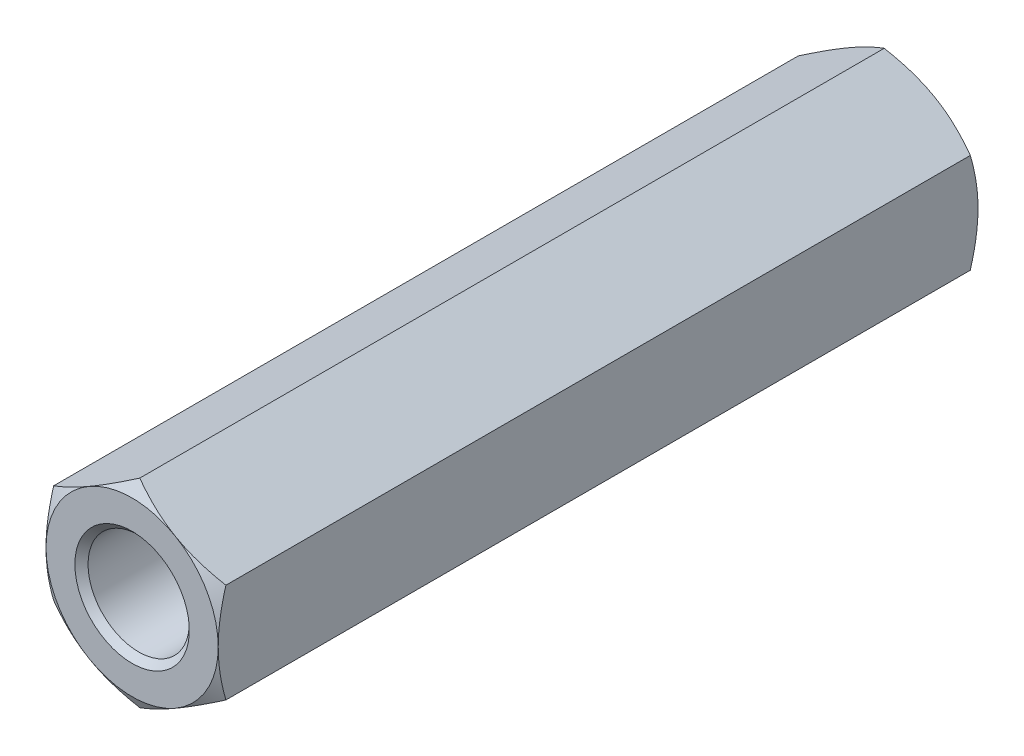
ISO-10303-21;
HEADER;
FILE_DESCRIPTION(('STEP AP214'),'2;1');
FILE_NAME('part.step','',(''),(''),'','','');
FILE_SCHEMA(('AUTOMOTIVE_DESIGN { 1 0 10303 214 1 1 1 1 }'));
ENDSEC;
DATA;
#1=APPLICATION_CONTEXT('core data for automotive mechanical design processes');
#2=APPLICATION_PROTOCOL_DEFINITION('international standard','automotive_design',2000,#1);
#3=PRODUCT_CONTEXT('',#1,'mechanical');
#4=PRODUCT('Part','Part','',(#3));
#5=PRODUCT_RELATED_PRODUCT_CATEGORY('part','',(#4));
#6=PRODUCT_DEFINITION_FORMATION('','',#4);
#7=PRODUCT_DEFINITION_CONTEXT('part definition',#1,'design');
#8=PRODUCT_DEFINITION('design','',#6,#7);
#9=PRODUCT_DEFINITION_SHAPE('','',#8);
#10=(LENGTH_UNIT() NAMED_UNIT(*) SI_UNIT(.MILLI.,.METRE.));
#11=(NAMED_UNIT(*) PLANE_ANGLE_UNIT() SI_UNIT($,.RADIAN.));
#12=(NAMED_UNIT(*) SI_UNIT($,.STERADIAN.) SOLID_ANGLE_UNIT());
#13=UNCERTAINTY_MEASURE_WITH_UNIT(LENGTH_MEASURE(1.E-05),#10,'distance_accuracy_value','');
#14=(GEOMETRIC_REPRESENTATION_CONTEXT(3) GLOBAL_UNCERTAINTY_ASSIGNED_CONTEXT((#13)) GLOBAL_UNIT_ASSIGNED_CONTEXT((#10,
#11,#12)) REPRESENTATION_CONTEXT('',''));
#15=CARTESIAN_POINT('',(0.,0.,0.));
#16=DIRECTION('',(0.,0.,1.));
#17=DIRECTION('',(1.,0.,0.));
#18=AXIS2_PLACEMENT_3D('',#15,#16,#17);
#19=CARTESIAN_POINT('',(8.5,4.90747728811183,75.));
#20=DIRECTION('',(-0.5,-0.866025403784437,0.));
#21=DIRECTION('',(-0.866025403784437,0.5,0.));
#22=AXIS2_PLACEMENT_3D('',#19,#20,#21);
#23=PLANE('',#22);
#24=CARTESIAN_POINT('',(-0.000199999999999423,9.8150700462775,0.759256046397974));
#25=CARTESIAN_POINT('',(0.18663922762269,9.70719836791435,0.696986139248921));
#26=CARTESIAN_POINT('',(0.374175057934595,9.59892450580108,0.637542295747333));
#27=CARTESIAN_POINT('',(0.750769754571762,9.38149745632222,0.525085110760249));
#28=CARTESIAN_POINT('',(0.939829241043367,9.27234391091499,0.47207454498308));
#29=CARTESIAN_POINT('',(1.5100347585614,8.94313560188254,0.323733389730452));
#30=CARTESIAN_POINT('',(1.89343164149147,8.72178130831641,0.239358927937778));
#31=CARTESIAN_POINT('',(2.46717766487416,8.39052888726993,0.140420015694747));
#32=CARTESIAN_POINT('',(2.65581276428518,8.28162036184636,0.11223519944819));
#33=CARTESIAN_POINT('',(3.03393602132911,8.06331079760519,0.0649740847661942));
#34=CARTESIAN_POINT('',(3.22342410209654,7.95390980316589,0.0458969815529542));
#35=CARTESIAN_POINT('',(3.6027265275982,7.73491944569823,0.0173347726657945));
#36=CARTESIAN_POINT('',(3.79254025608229,7.62533043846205,0.00783878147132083));
#37=CARTESIAN_POINT('',(4.17234305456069,7.40605119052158,-0.00135762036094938));
#38=CARTESIAN_POINT('',(4.36233211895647,7.29636095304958,-0.00105833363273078));
#39=CARTESIAN_POINT('',(4.71752301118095,7.09129139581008,0.00865447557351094));
#40=CARTESIAN_POINT('',(4.8827499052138,6.99589760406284,0.0168831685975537));
#41=CARTESIAN_POINT('',(5.21281671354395,6.80533344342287,0.0405892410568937));
#42=CARTESIAN_POINT('',(5.37765660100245,6.71016309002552,0.056067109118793));
#43=CARTESIAN_POINT('',(5.87153810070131,6.4250204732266,0.113008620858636));
#44=CARTESIAN_POINT('',(6.19970550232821,6.23555293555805,0.164973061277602));
#45=CARTESIAN_POINT('',(6.85952142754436,5.85460803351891,0.294884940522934));
#46=CARTESIAN_POINT('',(7.19108574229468,5.66317928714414,0.373383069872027));
#47=CARTESIAN_POINT('',(7.84926989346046,5.28317649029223,0.551541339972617));
#48=CARTESIAN_POINT('',(8.17589815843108,5.0945975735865,0.651159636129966));
#49=CARTESIAN_POINT('',(8.5002,4.90736181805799,0.759256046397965));
#50=B_SPLINE_CURVE_WITH_KNOTS('',3,(#24,#25,#26,#27,#28,#29,#30,#31,#32,#33,#34,#35,#36,#37,#38,
#39,#40,#41,#42,#43,#44,#45,#46,#47,#48,#49),.UNSPECIFIED.,.F.,.F.,(4,2,2,2,2,2,2,2,2,2,2,2,4),
(0.,0.673596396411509,1.34748239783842,2.69805431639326,3.356799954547,4.01548737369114,
4.67342558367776,5.33134346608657,5.90409556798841,6.47688628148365,7.62328361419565,
8.79510569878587,9.96462743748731),.UNSPECIFIED.);
#51=CARTESIAN_POINT('',(0.,9.81495457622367,0.759189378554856));
#52=VERTEX_POINT('',#51);
#53=CARTESIAN_POINT('',(4.25,7.36121593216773,0.));
#54=VERTEX_POINT('',#53);
#55=EDGE_CURVE('E330',#52,#54,#50,.T.);
#56=ORIENTED_EDGE('',*,*,#55,.F.);
#57=DIRECTION('',(0.,0.,-1.));
#58=VECTOR('',#57,1.);
#59=CARTESIAN_POINT('',(0.,9.81495457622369,75.));
#60=LINE('',#59,#58);
#61=CARTESIAN_POINT('',(0.,9.81495457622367,74.2408106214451));
#62=VERTEX_POINT('',#61);
#63=EDGE_CURVE('E239',#62,#52,#60,.T.);
#64=ORIENTED_EDGE('',*,*,#63,.F.);
#65=CARTESIAN_POINT('',(8.5002,4.90736181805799,74.240743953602));
#66=CARTESIAN_POINT('',(8.31336077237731,5.01523349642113,74.3030138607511));
#67=CARTESIAN_POINT('',(8.12582494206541,5.12350735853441,74.3624577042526));
#68=CARTESIAN_POINT('',(7.74923024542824,5.34093440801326,74.4749148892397));
#69=CARTESIAN_POINT('',(7.56017075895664,5.4500879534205,74.5279254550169));
#70=CARTESIAN_POINT('',(6.9899652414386,5.77929626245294,74.6762666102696));
#71=CARTESIAN_POINT('',(6.60656835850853,6.00065055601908,74.7606410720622));
#72=CARTESIAN_POINT('',(6.03282233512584,6.33190297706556,74.8595799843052));
#73=CARTESIAN_POINT('',(5.84418723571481,6.44081150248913,74.8877648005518));
#74=CARTESIAN_POINT('',(5.46606397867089,6.6591210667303,74.9350259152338));
#75=CARTESIAN_POINT('',(5.27657589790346,6.7685220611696,74.954103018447));
#76=CARTESIAN_POINT('',(4.8972734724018,6.98751241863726,74.9826652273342));
#77=CARTESIAN_POINT('',(4.70745974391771,7.09710142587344,74.9921612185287));
#78=CARTESIAN_POINT('',(4.32765694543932,7.31638067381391,75.001357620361));
#79=CARTESIAN_POINT('',(4.13766788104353,7.4260709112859,75.0010583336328));
#80=CARTESIAN_POINT('',(3.78247698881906,7.6311404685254,74.9913455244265));
#81=CARTESIAN_POINT('',(3.61725009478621,7.72653426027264,74.9831168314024));
#82=CARTESIAN_POINT('',(3.28718328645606,7.91709842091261,74.9594107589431));
#83=CARTESIAN_POINT('',(3.12234339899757,8.01226877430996,74.9439328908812));
#84=CARTESIAN_POINT('',(2.6284618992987,8.29741139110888,74.8869913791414));
#85=CARTESIAN_POINT('',(2.3002944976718,8.48687892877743,74.8350269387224));
#86=CARTESIAN_POINT('',(1.64047857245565,8.86782383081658,74.705115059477));
#87=CARTESIAN_POINT('',(1.30891425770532,9.05925257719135,74.626616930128));
#88=CARTESIAN_POINT('',(0.650730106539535,9.43925537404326,74.4484586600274));
#89=CARTESIAN_POINT('',(0.324101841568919,9.62783429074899,74.34884036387));
#90=CARTESIAN_POINT('',(-0.000199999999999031,9.8150700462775,74.240743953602));
#91=B_SPLINE_CURVE_WITH_KNOTS('',3,(#65,#66,#67,#68,#69,#70,#71,#72,#73,#74,#75,#76,#77,#78,#79,
#80,#81,#82,#83,#84,#85,#86,#87,#88,#89,#90),.UNSPECIFIED.,.F.,.F.,(4,2,2,2,2,2,2,2,2,2,2,2,4),
(0.,0.673596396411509,1.34748239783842,2.69805431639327,3.35679995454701,4.01548737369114,
4.67342558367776,5.33134346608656,5.9040955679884,6.47688628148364,7.62328361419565,
8.79510569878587,9.96462743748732),.UNSPECIFIED.);
#92=CARTESIAN_POINT('',(4.25,7.36121593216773,75.));
#93=VERTEX_POINT('',#92);
#94=EDGE_CURVE('E225',#93,#62,#91,.T.);
#95=ORIENTED_EDGE('',*,*,#94,.F.);
#96=CARTESIAN_POINT('',(8.5,4.90747728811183,74.2408106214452));
#97=VERTEX_POINT('',#96);
#98=EDGE_CURVE('E301',#97,#93,#91,.T.);
#99=ORIENTED_EDGE('',*,*,#98,.F.);
#100=DIRECTION('',(0.,0.,-1.));
#101=VECTOR('',#100,1.);
#102=CARTESIAN_POINT('',(8.5,4.90747728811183,75.));
#103=LINE('',#102,#101);
#104=CARTESIAN_POINT('',(8.5,4.90747728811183,0.759189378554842));
#105=VERTEX_POINT('',#104);
#106=EDGE_CURVE('E227',#97,#105,#103,.T.);
#107=ORIENTED_EDGE('',*,*,#106,.T.);
#108=EDGE_CURVE('E37',#54,#105,#50,.T.);
#109=ORIENTED_EDGE('',*,*,#108,.F.);
#110=EDGE_LOOP('',(#56,#64,#95,#99,#107,#109));
#111=FACE_BOUND('',#110,.T.);
#112=ADVANCED_FACE('F14',(#111),#23,.F.);
#113=CARTESIAN_POINT('',(-8.5,4.90747728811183,75.));
#114=DIRECTION('',(-0.5,0.866025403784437,0.));
#115=DIRECTION('',(0.866025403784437,0.5,0.));
#116=AXIS2_PLACEMENT_3D('',#113,#114,#115);
#117=PLANE('',#116);
#118=ORIENTED_EDGE('',*,*,#63,.T.);
#119=CARTESIAN_POINT('',(0.000199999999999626,9.8150700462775,0.759256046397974));
#120=CARTESIAN_POINT('',(-0.18663922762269,9.70719836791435,0.696986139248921));
#121=CARTESIAN_POINT('',(-0.374175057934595,9.59892450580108,0.637542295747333));
#122=CARTESIAN_POINT('',(-0.750769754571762,9.38149745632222,0.525085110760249));
#123=CARTESIAN_POINT('',(-0.939829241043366,9.27234391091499,0.47207454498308));
#124=CARTESIAN_POINT('',(-1.5100347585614,8.94313560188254,0.323733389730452));
#125=CARTESIAN_POINT('',(-1.89343164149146,8.7217813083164,0.239358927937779));
#126=CARTESIAN_POINT('',(-2.46717766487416,8.39052888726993,0.140420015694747));
#127=CARTESIAN_POINT('',(-2.65581276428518,8.28162036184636,0.112235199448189));
#128=CARTESIAN_POINT('',(-3.03393602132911,8.06331079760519,0.0649740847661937));
#129=CARTESIAN_POINT('',(-3.22342410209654,7.95390980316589,0.0458969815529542));
#130=CARTESIAN_POINT('',(-3.6027265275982,7.73491944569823,0.0173347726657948));
#131=CARTESIAN_POINT('',(-3.79254025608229,7.62533043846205,0.00783878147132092));
#132=CARTESIAN_POINT('',(-4.17234305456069,7.40605119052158,-0.00135762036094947));
#133=CARTESIAN_POINT('',(-4.36233211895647,7.29636095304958,-0.00105833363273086));
#134=CARTESIAN_POINT('',(-4.71752301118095,7.09129139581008,0.008654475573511));
#135=CARTESIAN_POINT('',(-4.8827499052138,6.99589760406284,0.0168831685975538));
#136=CARTESIAN_POINT('',(-5.21281671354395,6.80533344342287,0.040589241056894));
#137=CARTESIAN_POINT('',(-5.37765660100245,6.71016309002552,0.0560671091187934));
#138=CARTESIAN_POINT('',(-5.87153810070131,6.4250204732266,0.113008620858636));
#139=CARTESIAN_POINT('',(-6.19970550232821,6.23555293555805,0.164973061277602));
#140=CARTESIAN_POINT('',(-6.85952142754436,5.85460803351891,0.294884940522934));
#141=CARTESIAN_POINT('',(-7.19108574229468,5.66317928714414,0.373383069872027));
#142=CARTESIAN_POINT('',(-7.84926989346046,5.28317649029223,0.551541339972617));
#143=CARTESIAN_POINT('',(-8.17589815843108,5.0945975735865,0.651159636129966));
#144=CARTESIAN_POINT('',(-8.5002,4.90736181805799,0.759256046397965));
#145=B_SPLINE_CURVE_WITH_KNOTS('',3,(#119,#120,#121,#122,#123,#124,#125,#126,#127,#128,#129,
#130,#131,#132,#133,#134,#135,#136,#137,#138,#139,#140,#141,#142,#143,#144),.UNSPECIFIED.,.F.,
.F.,(4,2,2,2,2,2,2,2,2,2,2,2,4),(0.,0.673596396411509,1.34748239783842,2.69805431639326,
3.356799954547,4.01548737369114,4.67342558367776,5.33134346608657,5.90409556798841,
6.47688628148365,7.62328361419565,8.79510569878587,9.96462743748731),.UNSPECIFIED.);
#146=CARTESIAN_POINT('',(-4.25,7.36121593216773,0.));
#147=VERTEX_POINT('',#146);
#148=EDGE_CURVE('E184',#52,#147,#145,.T.);
#149=ORIENTED_EDGE('',*,*,#148,.T.);
#150=CARTESIAN_POINT('',(-8.5,4.90747728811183,0.759189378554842));
#151=VERTEX_POINT('',#150);
#152=EDGE_CURVE('E319',#147,#151,#145,.T.);
#153=ORIENTED_EDGE('',*,*,#152,.T.);
#154=DIRECTION('',(0.,0.,-1.));
#155=VECTOR('',#154,1.);
#156=CARTESIAN_POINT('',(-8.5,4.90747728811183,75.));
#157=LINE('',#156,#155);
#158=CARTESIAN_POINT('',(-8.5,4.90747728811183,74.2408106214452));
#159=VERTEX_POINT('',#158);
#160=EDGE_CURVE('E236',#159,#151,#157,.T.);
#161=ORIENTED_EDGE('',*,*,#160,.F.);
#162=CARTESIAN_POINT('',(-8.5002,4.90736181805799,74.240743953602));
#163=CARTESIAN_POINT('',(-8.31336077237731,5.01523349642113,74.3030138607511));
#164=CARTESIAN_POINT('',(-8.12582494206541,5.12350735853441,74.3624577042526));
#165=CARTESIAN_POINT('',(-7.74923024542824,5.34093440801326,74.4749148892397));
#166=CARTESIAN_POINT('',(-7.56017075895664,5.4500879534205,74.5279254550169));
#167=CARTESIAN_POINT('',(-6.9899652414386,5.77929626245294,74.6762666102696));
#168=CARTESIAN_POINT('',(-6.60656835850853,6.00065055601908,74.7606410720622));
#169=CARTESIAN_POINT('',(-6.03282233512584,6.33190297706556,74.8595799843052));
#170=CARTESIAN_POINT('',(-5.84418723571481,6.44081150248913,74.8877648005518));
#171=CARTESIAN_POINT('',(-5.46606397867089,6.6591210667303,74.9350259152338));
#172=CARTESIAN_POINT('',(-5.27657589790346,6.7685220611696,74.954103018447));
#173=CARTESIAN_POINT('',(-4.8972734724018,6.98751241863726,74.9826652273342));
#174=CARTESIAN_POINT('',(-4.70745974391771,7.09710142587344,74.9921612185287));
#175=CARTESIAN_POINT('',(-4.32765694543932,7.31638067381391,75.001357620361));
#176=CARTESIAN_POINT('',(-4.13766788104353,7.4260709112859,75.0010583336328));
#177=CARTESIAN_POINT('',(-3.78247698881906,7.6311404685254,74.9913455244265));
#178=CARTESIAN_POINT('',(-3.61725009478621,7.72653426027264,74.9831168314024));
#179=CARTESIAN_POINT('',(-3.28718328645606,7.91709842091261,74.9594107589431));
#180=CARTESIAN_POINT('',(-3.12234339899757,8.01226877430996,74.9439328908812));
#181=CARTESIAN_POINT('',(-2.6284618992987,8.29741139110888,74.8869913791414));
#182=CARTESIAN_POINT('',(-2.3002944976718,8.48687892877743,74.8350269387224));
#183=CARTESIAN_POINT('',(-1.64047857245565,8.86782383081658,74.705115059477));
#184=CARTESIAN_POINT('',(-1.30891425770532,9.05925257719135,74.626616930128));
#185=CARTESIAN_POINT('',(-0.650730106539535,9.43925537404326,74.4484586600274));
#186=CARTESIAN_POINT('',(-0.324101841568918,9.62783429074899,74.34884036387));
#187=CARTESIAN_POINT('',(0.000199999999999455,9.8150700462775,74.240743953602));
#188=B_SPLINE_CURVE_WITH_KNOTS('',3,(#162,#163,#164,#165,#166,#167,#168,#169,#170,#171,#172,
#173,#174,#175,#176,#177,#178,#179,#180,#181,#182,#183,#184,#185,#186,#187),.UNSPECIFIED.,.F.,
.F.,(4,2,2,2,2,2,2,2,2,2,2,2,4),(0.,0.673596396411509,1.34748239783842,2.69805431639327,
3.35679995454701,4.01548737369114,4.67342558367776,5.33134346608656,5.9040955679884,
6.47688628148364,7.62328361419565,8.79510569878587,9.96462743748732),.UNSPECIFIED.);
#189=CARTESIAN_POINT('',(-4.25,7.36121593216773,75.));
#190=VERTEX_POINT('',#189);
#191=EDGE_CURVE('E218',#159,#190,#188,.T.);
#192=ORIENTED_EDGE('',*,*,#191,.T.);
#193=EDGE_CURVE('E226',#190,#62,#188,.T.);
#194=ORIENTED_EDGE('',*,*,#193,.T.);
#195=EDGE_LOOP('',(#118,#149,#153,#161,#192,#194));
#196=FACE_BOUND('',#195,.T.);
#197=ADVANCED_FACE('F197',(#196),#117,.T.);
#198=CARTESIAN_POINT('',(-8.5,4.90747728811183,75.));
#199=DIRECTION('',(1.,0.,0.));
#200=DIRECTION('',(0.,0.,-1.));
#201=AXIS2_PLACEMENT_3D('',#198,#199,#200);
#202=PLANE('',#201);
#203=CARTESIAN_POINT('',(-8.5,-13.2011193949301,4.15746531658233));
#204=CARTESIAN_POINT('',(-8.5,-12.8297165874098,3.97722520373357));
#205=CARTESIAN_POINT('',(-8.5,-12.4574632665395,3.79870776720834));
#206=CARTESIAN_POINT('',(-8.5,-11.7108033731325,3.44608669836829));
#207=CARTESIAN_POINT('',(-8.5,-11.3363964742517,3.27198375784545));
#208=CARTESIAN_POINT('',(-8.5,-10.5830571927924,2.92828826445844));
#209=CARTESIAN_POINT('',(-8.5,-10.2041112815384,2.75872526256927));
#210=CARTESIAN_POINT('',(-8.5,-9.44321228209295,2.42651264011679));
#211=CARTESIAN_POINT('',(-8.5,-9.06125933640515,2.26386269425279));
#212=CARTESIAN_POINT('',(-8.5,-8.28131926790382,1.94217834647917));
#213=CARTESIAN_POINT('',(-8.5,-7.88321309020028,1.78343100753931));
#214=CARTESIAN_POINT('',(-8.5,-7.08235110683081,1.47790481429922));
#215=CARTESIAN_POINT('',(-8.5,-6.67959478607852,1.33112730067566));
#216=CARTESIAN_POINT('',(-8.5,-5.86953465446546,1.05338053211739));
#217=CARTESIAN_POINT('',(-8.5,-5.46224187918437,0.922379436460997));
#218=CARTESIAN_POINT('',(-8.5,-4.64182831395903,0.680374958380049));
#219=CARTESIAN_POINT('',(-8.5,-4.22870939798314,0.569365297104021));
#220=CARTESIAN_POINT('',(-8.5,-3.39864679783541,0.373259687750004));
#221=CARTESIAN_POINT('',(-8.5,-2.98173753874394,0.288021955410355));
#222=CARTESIAN_POINT('',(-8.5,-2.35256180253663,0.183172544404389));
#223=CARTESIAN_POINT('',(-8.5,-2.14218590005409,0.152055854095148));
#224=CARTESIAN_POINT('',(-8.5,-1.72038194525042,0.0981014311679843));
#225=CARTESIAN_POINT('',(-8.5,-1.50895399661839,0.0752628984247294));
#226=CARTESIAN_POINT('',(-8.5,-1.08809927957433,0.0386071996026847));
#227=CARTESIAN_POINT('',(-8.5,-0.878682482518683,0.0246760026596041));
#228=CARTESIAN_POINT('',(-8.5,-0.459447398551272,0.00568288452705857));
#229=CARTESIAN_POINT('',(-8.5,-0.249629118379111,0.000620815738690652));
#230=CARTESIAN_POINT('',(-8.5,0.170033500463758,-0.000513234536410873));
#231=CARTESIAN_POINT('',(-8.5,0.379877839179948,0.00341479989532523));
#232=CARTESIAN_POINT('',(-8.5,0.799213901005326,0.0201646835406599));
#233=CARTESIAN_POINT('',(-8.5,1.00870560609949,0.0329869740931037));
#234=CARTESIAN_POINT('',(-8.5,1.51161230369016,0.0741724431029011));
#235=CARTESIAN_POINT('',(-8.5,1.80469155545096,0.106724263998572));
#236=CARTESIAN_POINT('',(-8.5,2.38867345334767,0.187464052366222));
#237=CARTESIAN_POINT('',(-8.5,2.67957580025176,0.235654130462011));
#238=CARTESIAN_POINT('',(-8.5,3.5486867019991,0.401126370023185));
#239=CARTESIAN_POINT('',(-8.5,4.12297391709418,0.539280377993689));
#240=CARTESIAN_POINT('',(-8.5,4.98168361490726,0.778835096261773));
#241=CARTESIAN_POINT('',(-8.5,5.27056095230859,0.865185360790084));
#242=CARTESIAN_POINT('',(-8.5,5.84551003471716,1.04685220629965));
#243=CARTESIAN_POINT('',(-8.5,6.13158176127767,1.14216884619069));
#244=CARTESIAN_POINT('',(-8.5,6.70100932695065,1.34023935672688));
#245=CARTESIAN_POINT('',(-8.5,6.98436602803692,1.44299077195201));
#246=CARTESIAN_POINT('',(-8.5,7.54873222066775,1.65472213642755));
#247=CARTESIAN_POINT('',(-8.5,7.82974173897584,1.76370201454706));
#248=CARTESIAN_POINT('',(-8.5,8.48975893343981,2.02674433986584));
#249=CARTESIAN_POINT('',(-8.5,8.86789193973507,2.18299733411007));
#250=CARTESIAN_POINT('',(-8.5,9.62095814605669,2.50305469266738));
#251=CARTESIAN_POINT('',(-8.5,9.99589115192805,2.66685951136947));
#252=CARTESIAN_POINT('',(-8.5,10.7431486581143,3.00051747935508));
#253=CARTESIAN_POINT('',(-8.5,11.115472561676,3.17037196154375));
#254=CARTESIAN_POINT('',(-8.5,11.8578611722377,3.51491651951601));
#255=CARTESIAN_POINT('',(-8.5,12.2279259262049,3.68960649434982));
#256=CARTESIAN_POINT('',(-8.5,12.966569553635,4.0431130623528));
#257=CARTESIAN_POINT('',(-8.5,13.3351463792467,4.22193392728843));
#258=CARTESIAN_POINT('',(-8.5,14.0707086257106,4.58282227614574));
#259=CARTESIAN_POINT('',(-8.5,14.4376940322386,4.76488978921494));
#260=CARTESIAN_POINT('',(-8.5,15.5365441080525,5.31505491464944));
#261=CARTESIAN_POINT('',(-8.5,16.2664008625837,5.68716251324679));
#262=CARTESIAN_POINT('',(-8.5,17.6615650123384,6.40759179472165));
#263=CARTESIAN_POINT('',(-8.5,18.3271842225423,6.75531232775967));
#264=CARTESIAN_POINT('',(-8.5,19.6559320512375,7.45553257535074));
#265=CARTESIAN_POINT('',(-8.5,20.3190605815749,7.80803245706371));
#266=CARTESIAN_POINT('',(-8.5,21.6417247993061,8.51579328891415));
#267=CARTESIAN_POINT('',(-8.5,22.3012653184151,8.87104522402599));
#268=CARTESIAN_POINT('',(-8.5,23.6187518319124,9.58440860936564));
#269=CARTESIAN_POINT('',(-8.5,24.2766979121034,9.9425199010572));
#270=CARTESIAN_POINT('',(-8.5,24.9340563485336,10.3016993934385));
#271=B_SPLINE_CURVE_WITH_KNOTS('',3,(#203,#204,#205,#206,#207,#208,#209,#210,#211,#212,#213,
#214,#215,#216,#217,#218,#219,#220,#221,#222,#223,#224,#225,#226,#227,#228,#229,#230,#231,#232,
#233,#234,#235,#236,#237,#238,#239,#240,#241,#242,#243,#244,#245,#246,#247,#248,#249,#250,#251,
#252,#253,#254,#255,#256,#257,#258,#259,#260,#261,#262,#263,#264,#265,#266,#267,#268,#269,#270),
.UNSPECIFIED.,.F.,.F.,(4,2,2,2,2,2,2,2,2,2,2,2,2,2,2,2,2,2,2,2,2,2,2,2,2,2,2,2,2,2,2,2,2,4),(0.,
1.23849752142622,2.47718794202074,3.72259015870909,4.96793370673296,6.25355383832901,
7.53931776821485,8.82244160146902,10.1051617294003,11.3806908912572,12.0185477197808,
12.6563428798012,13.2858003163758,13.9152472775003,14.544695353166,15.1741746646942,
16.0583197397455,16.9425841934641,18.7120884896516,19.616533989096,20.5209854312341,
21.4251395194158,22.329283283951,23.5566078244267,24.7840063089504,26.0116769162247,
27.2393219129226,28.4682989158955,29.6972869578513,32.1549358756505,34.4078302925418,
36.6608037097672,38.9081899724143,41.1554524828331),.UNSPECIFIED.);
#272=CARTESIAN_POINT('',(-8.5,-4.90747728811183,0.759189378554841));
#273=VERTEX_POINT('',#272);
#274=CARTESIAN_POINT('',(-8.5,0.,0.));
#275=VERTEX_POINT('',#274);
#276=EDGE_CURVE('E178',#273,#275,#271,.T.);
#277=ORIENTED_EDGE('',*,*,#276,.F.);
#278=DIRECTION('',(0.,0.,-1.));
#279=VECTOR('',#278,1.);
#280=CARTESIAN_POINT('',(-8.5,-4.90747728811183,75.));
#281=LINE('',#280,#279);
#282=CARTESIAN_POINT('',(-8.5,-4.90747728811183,74.2408106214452));
#283=VERTEX_POINT('',#282);
#284=EDGE_CURVE('E233',#283,#273,#281,.T.);
#285=ORIENTED_EDGE('',*,*,#284,.F.);
#286=CARTESIAN_POINT('',(-8.5,-13.2011193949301,70.8425346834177));
#287=CARTESIAN_POINT('',(-8.5,-12.8297165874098,71.0227747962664));
#288=CARTESIAN_POINT('',(-8.5,-12.4574632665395,71.2012922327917));
#289=CARTESIAN_POINT('',(-8.5,-11.7108033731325,71.5539133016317));
#290=CARTESIAN_POINT('',(-8.5,-11.3363964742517,71.7280162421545));
#291=CARTESIAN_POINT('',(-8.5,-10.5830571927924,72.0717117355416));
#292=CARTESIAN_POINT('',(-8.5,-10.2041112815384,72.2412747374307));
#293=CARTESIAN_POINT('',(-8.5,-9.44321228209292,72.5734873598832));
#294=CARTESIAN_POINT('',(-8.5,-9.06125933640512,72.7361373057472));
#295=CARTESIAN_POINT('',(-8.5,-8.28131926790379,73.0578216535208));
#296=CARTESIAN_POINT('',(-8.5,-7.88321309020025,73.2165689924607));
#297=CARTESIAN_POINT('',(-8.5,-7.08235110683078,73.5220951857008));
#298=CARTESIAN_POINT('',(-8.5,-6.6795947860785,73.6688726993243));
#299=CARTESIAN_POINT('',(-8.5,-5.86953465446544,73.9466194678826));
#300=CARTESIAN_POINT('',(-8.5,-5.46224187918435,74.077620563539));
#301=CARTESIAN_POINT('',(-8.5,-4.64182831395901,74.31962504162));
#302=CARTESIAN_POINT('',(-8.5,-4.22870939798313,74.430634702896));
#303=CARTESIAN_POINT('',(-8.5,-3.39864679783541,74.62674031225));
#304=CARTESIAN_POINT('',(-8.5,-2.98173753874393,74.7119780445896));
#305=CARTESIAN_POINT('',(-8.5,-2.35256180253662,74.8168274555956));
#306=CARTESIAN_POINT('',(-8.5,-2.14218590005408,74.8479441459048));
#307=CARTESIAN_POINT('',(-8.5,-1.72038194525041,74.901898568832));
#308=CARTESIAN_POINT('',(-8.5,-1.50895399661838,74.9247371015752));
#309=CARTESIAN_POINT('',(-8.5,-1.08809927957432,74.9613928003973));
#310=CARTESIAN_POINT('',(-8.5,-0.878682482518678,74.9753239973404));
#311=CARTESIAN_POINT('',(-8.5,-0.459447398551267,74.9943171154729));
#312=CARTESIAN_POINT('',(-8.5,-0.249629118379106,74.9993791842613));
#313=CARTESIAN_POINT('',(-8.5,0.170033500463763,75.0005132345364));
#314=CARTESIAN_POINT('',(-8.5,0.379877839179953,74.9965852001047));
#315=CARTESIAN_POINT('',(-8.5,0.79921390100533,74.9798353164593));
#316=CARTESIAN_POINT('',(-8.5,1.00870560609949,74.9670130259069));
#317=CARTESIAN_POINT('',(-8.5,1.51161230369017,74.9258275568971));
#318=CARTESIAN_POINT('',(-8.5,1.80469155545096,74.8932757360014));
#319=CARTESIAN_POINT('',(-8.5,2.38867345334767,74.8125359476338));
#320=CARTESIAN_POINT('',(-8.5,2.67957580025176,74.764345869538));
#321=CARTESIAN_POINT('',(-8.5,3.5486867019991,74.5988736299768));
#322=CARTESIAN_POINT('',(-8.5,4.12297391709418,74.4607196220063));
#323=CARTESIAN_POINT('',(-8.5,4.98168361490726,74.2211649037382));
#324=CARTESIAN_POINT('',(-8.5,5.27056095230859,74.1348146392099));
#325=CARTESIAN_POINT('',(-8.5,5.84551003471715,73.9531477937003));
#326=CARTESIAN_POINT('',(-8.5,6.13158176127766,73.8578311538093));
#327=CARTESIAN_POINT('',(-8.5,6.70100932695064,73.6597606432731));
#328=CARTESIAN_POINT('',(-8.5,6.98436602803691,73.557009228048));
#329=CARTESIAN_POINT('',(-8.5,7.54873222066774,73.3452778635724));
#330=CARTESIAN_POINT('',(-8.5,7.82974173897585,73.236297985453));
#331=CARTESIAN_POINT('',(-8.5,8.48975893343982,72.9732556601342));
#332=CARTESIAN_POINT('',(-8.5,8.86789193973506,72.8170026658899));
#333=CARTESIAN_POINT('',(-8.5,9.62095814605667,72.4969453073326));
#334=CARTESIAN_POINT('',(-8.5,9.99589115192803,72.3331404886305));
#335=CARTESIAN_POINT('',(-8.5,10.7431486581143,71.9994825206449));
#336=CARTESIAN_POINT('',(-8.5,11.115472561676,71.8296280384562));
#337=CARTESIAN_POINT('',(-8.5,11.8578611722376,71.485083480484));
#338=CARTESIAN_POINT('',(-8.5,12.2279259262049,71.3103935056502));
#339=CARTESIAN_POINT('',(-8.5,12.966569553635,70.9568869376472));
#340=CARTESIAN_POINT('',(-8.5,13.3351463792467,70.7780660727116));
#341=CARTESIAN_POINT('',(-8.5,14.0707086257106,70.4171777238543));
#342=CARTESIAN_POINT('',(-8.5,14.4376940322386,70.2351102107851));
#343=CARTESIAN_POINT('',(-8.5,15.5365441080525,69.6849450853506));
#344=CARTESIAN_POINT('',(-8.5,16.2664008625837,69.3128374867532));
#345=CARTESIAN_POINT('',(-8.5,17.6615650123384,68.5924082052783));
#346=CARTESIAN_POINT('',(-8.5,18.3271842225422,68.2446876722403));
#347=CARTESIAN_POINT('',(-8.5,19.6559320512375,67.5444674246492));
#348=CARTESIAN_POINT('',(-8.5,20.3190605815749,67.1919675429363));
#349=CARTESIAN_POINT('',(-8.5,21.6417247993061,66.4842067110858));
#350=CARTESIAN_POINT('',(-8.5,22.3012653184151,66.128954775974));
#351=CARTESIAN_POINT('',(-8.5,23.6187518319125,65.4155913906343));
#352=CARTESIAN_POINT('',(-8.5,24.2766979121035,65.0574800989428));
#353=CARTESIAN_POINT('',(-8.5,24.9340563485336,64.6983006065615));
#354=B_SPLINE_CURVE_WITH_KNOTS('',3,(#286,#287,#288,#289,#290,#291,#292,#293,#294,#295,#296,
#297,#298,#299,#300,#301,#302,#303,#304,#305,#306,#307,#308,#309,#310,#311,#312,#313,#314,#315,
#316,#317,#318,#319,#320,#321,#322,#323,#324,#325,#326,#327,#328,#329,#330,#331,#332,#333,#334,
#335,#336,#337,#338,#339,#340,#341,#342,#343,#344,#345,#346,#347,#348,#349,#350,#351,#352,#353),
.UNSPECIFIED.,.F.,.F.,(4,2,2,2,2,2,2,2,2,2,2,2,2,2,2,2,2,2,2,2,2,2,2,2,2,2,2,2,2,2,2,2,2,4),(0.,
1.23849752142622,2.47718794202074,3.7225901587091,4.96793370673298,6.25355383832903,
7.53931776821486,8.82244160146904,10.1051617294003,11.3806908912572,12.0185477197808,
12.6563428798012,13.2858003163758,13.9152472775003,14.544695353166,15.1741746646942,
16.0583197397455,16.9425841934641,18.7120884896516,19.616533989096,20.5209854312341,
21.4251395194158,22.3292832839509,23.5566078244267,24.7840063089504,26.0116769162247,
27.2393219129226,28.4682989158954,29.6972869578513,32.1549358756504,34.4078302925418,
36.6608037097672,38.9081899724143,41.1554524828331),.UNSPECIFIED.);
#355=CARTESIAN_POINT('',(-8.5,0.,75.));
#356=VERTEX_POINT('',#355);
#357=EDGE_CURVE('E203',#356,#283,#354,.F.);
#358=ORIENTED_EDGE('',*,*,#357,.F.);
#359=EDGE_CURVE('E210',#159,#356,#354,.F.);
#360=ORIENTED_EDGE('',*,*,#359,.F.);
#361=ORIENTED_EDGE('',*,*,#160,.T.);
#362=EDGE_CURVE('E186',#275,#151,#271,.T.);
#363=ORIENTED_EDGE('',*,*,#362,.F.);
#364=EDGE_LOOP('',(#277,#285,#358,#360,#361,#363));
#365=FACE_BOUND('',#364,.T.);
#366=ADVANCED_FACE('F193',(#365),#202,.F.);
#367=CARTESIAN_POINT('',(-8.5,-4.90747728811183,75.));
#368=DIRECTION('',(0.5,0.866025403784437,0.));
#369=DIRECTION('',(0.866025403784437,-0.5,0.));
#370=AXIS2_PLACEMENT_3D('',#367,#368,#369);
#371=PLANE('',#370);
#372=CARTESIAN_POINT('',(0.000199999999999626,-9.8150700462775,0.759256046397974));
#373=CARTESIAN_POINT('',(-0.18663922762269,-9.70719836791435,0.696986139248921));
#374=CARTESIAN_POINT('',(-0.374175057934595,-9.59892450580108,0.637542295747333));
#375=CARTESIAN_POINT('',(-0.750769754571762,-9.38149745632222,0.525085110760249));
#376=CARTESIAN_POINT('',(-0.939829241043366,-9.27234391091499,0.47207454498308));
#377=CARTESIAN_POINT('',(-1.5100347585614,-8.94313560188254,0.323733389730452));
#378=CARTESIAN_POINT('',(-1.89343164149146,-8.7217813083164,0.239358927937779));
#379=CARTESIAN_POINT('',(-2.46717766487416,-8.39052888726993,0.140420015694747));
#380=CARTESIAN_POINT('',(-2.65581276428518,-8.28162036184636,0.112235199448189));
#381=CARTESIAN_POINT('',(-3.03393602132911,-8.06331079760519,0.0649740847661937));
#382=CARTESIAN_POINT('',(-3.22342410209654,-7.95390980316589,0.0458969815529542));
#383=CARTESIAN_POINT('',(-3.6027265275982,-7.73491944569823,0.0173347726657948));
#384=CARTESIAN_POINT('',(-3.79254025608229,-7.62533043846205,0.00783878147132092));
#385=CARTESIAN_POINT('',(-4.17234305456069,-7.40605119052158,-0.00135762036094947));
#386=CARTESIAN_POINT('',(-4.36233211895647,-7.29636095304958,-0.00105833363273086));
#387=CARTESIAN_POINT('',(-4.71752301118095,-7.09129139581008,0.008654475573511));
#388=CARTESIAN_POINT('',(-4.8827499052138,-6.99589760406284,0.0168831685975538));
#389=CARTESIAN_POINT('',(-5.21281671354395,-6.80533344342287,0.040589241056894));
#390=CARTESIAN_POINT('',(-5.37765660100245,-6.71016309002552,0.0560671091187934));
#391=CARTESIAN_POINT('',(-5.87153810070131,-6.4250204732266,0.113008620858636));
#392=CARTESIAN_POINT('',(-6.19970550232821,-6.23555293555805,0.164973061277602));
#393=CARTESIAN_POINT('',(-6.85952142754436,-5.85460803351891,0.294884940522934));
#394=CARTESIAN_POINT('',(-7.19108574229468,-5.66317928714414,0.373383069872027));
#395=CARTESIAN_POINT('',(-7.84926989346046,-5.28317649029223,0.551541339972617));
#396=CARTESIAN_POINT('',(-8.17589815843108,-5.0945975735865,0.651159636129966));
#397=CARTESIAN_POINT('',(-8.5002,-4.90736181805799,0.759256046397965));
#398=B_SPLINE_CURVE_WITH_KNOTS('',3,(#372,#373,#374,#375,#376,#377,#378,#379,#380,#381,#382,
#383,#384,#385,#386,#387,#388,#389,#390,#391,#392,#393,#394,#395,#396,#397),.UNSPECIFIED.,.F.,
.F.,(4,2,2,2,2,2,2,2,2,2,2,2,4),(0.,0.673596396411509,1.34748239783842,2.69805431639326,
3.356799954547,4.01548737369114,4.67342558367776,5.33134346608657,5.90409556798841,
6.47688628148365,7.62328361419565,8.79510569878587,9.96462743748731),.UNSPECIFIED.);
#399=CARTESIAN_POINT('',(0.,-9.81495457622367,0.759189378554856));
#400=VERTEX_POINT('',#399);
#401=CARTESIAN_POINT('',(-4.25,-7.36121593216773,0.));
#402=VERTEX_POINT('',#401);
#403=EDGE_CURVE('E166',#400,#402,#398,.T.);
#404=ORIENTED_EDGE('',*,*,#403,.F.);
#405=DIRECTION('',(0.,0.,-1.));
#406=VECTOR('',#405,1.);
#407=CARTESIAN_POINT('',(0.,-9.81495457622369,75.));
#408=LINE('',#407,#406);
#409=CARTESIAN_POINT('',(0.,-9.81495457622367,74.2408106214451));
#410=VERTEX_POINT('',#409);
#411=EDGE_CURVE('E230',#410,#400,#408,.T.);
#412=ORIENTED_EDGE('',*,*,#411,.F.);
#413=CARTESIAN_POINT('',(-8.5002,-4.90736181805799,74.240743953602));
#414=CARTESIAN_POINT('',(-8.31336077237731,-5.01523349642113,74.3030138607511));
#415=CARTESIAN_POINT('',(-8.12582494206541,-5.12350735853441,74.3624577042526));
#416=CARTESIAN_POINT('',(-7.74923024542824,-5.34093440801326,74.4749148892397));
#417=CARTESIAN_POINT('',(-7.56017075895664,-5.4500879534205,74.5279254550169));
#418=CARTESIAN_POINT('',(-6.9899652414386,-5.77929626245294,74.6762666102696));
#419=CARTESIAN_POINT('',(-6.60656835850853,-6.00065055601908,74.7606410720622));
#420=CARTESIAN_POINT('',(-6.03282233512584,-6.33190297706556,74.8595799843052));
#421=CARTESIAN_POINT('',(-5.84418723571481,-6.44081150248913,74.8877648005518));
#422=CARTESIAN_POINT('',(-5.46606397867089,-6.6591210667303,74.9350259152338));
#423=CARTESIAN_POINT('',(-5.27657589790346,-6.7685220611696,74.954103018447));
#424=CARTESIAN_POINT('',(-4.8972734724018,-6.98751241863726,74.9826652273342));
#425=CARTESIAN_POINT('',(-4.70745974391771,-7.09710142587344,74.9921612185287));
#426=CARTESIAN_POINT('',(-4.32765694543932,-7.31638067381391,75.001357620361));
#427=CARTESIAN_POINT('',(-4.13766788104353,-7.4260709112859,75.0010583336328));
#428=CARTESIAN_POINT('',(-3.78247698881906,-7.6311404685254,74.9913455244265));
#429=CARTESIAN_POINT('',(-3.61725009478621,-7.72653426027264,74.9831168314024));
#430=CARTESIAN_POINT('',(-3.28718328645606,-7.91709842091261,74.9594107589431));
#431=CARTESIAN_POINT('',(-3.12234339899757,-8.01226877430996,74.9439328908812));
#432=CARTESIAN_POINT('',(-2.6284618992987,-8.29741139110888,74.8869913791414));
#433=CARTESIAN_POINT('',(-2.3002944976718,-8.48687892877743,74.8350269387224));
#434=CARTESIAN_POINT('',(-1.64047857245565,-8.86782383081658,74.705115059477));
#435=CARTESIAN_POINT('',(-1.30891425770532,-9.05925257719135,74.626616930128));
#436=CARTESIAN_POINT('',(-0.650730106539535,-9.43925537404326,74.4484586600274));
#437=CARTESIAN_POINT('',(-0.324101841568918,-9.62783429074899,74.34884036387));
#438=CARTESIAN_POINT('',(0.000199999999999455,-9.8150700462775,74.240743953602));
#439=B_SPLINE_CURVE_WITH_KNOTS('',3,(#413,#414,#415,#416,#417,#418,#419,#420,#421,#422,#423,
#424,#425,#426,#427,#428,#429,#430,#431,#432,#433,#434,#435,#436,#437,#438),.UNSPECIFIED.,.F.,
.F.,(4,2,2,2,2,2,2,2,2,2,2,2,4),(0.,0.673596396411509,1.34748239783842,2.69805431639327,
3.35679995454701,4.01548737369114,4.67342558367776,5.33134346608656,5.9040955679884,
6.47688628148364,7.62328361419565,8.79510569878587,9.96462743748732),.UNSPECIFIED.);
#440=CARTESIAN_POINT('',(-4.25,-7.36121593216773,75.));
#441=VERTEX_POINT('',#440);
#442=EDGE_CURVE('E212',#441,#410,#439,.T.);
#443=ORIENTED_EDGE('',*,*,#442,.F.);
#444=EDGE_CURVE('E211',#283,#441,#439,.T.);
#445=ORIENTED_EDGE('',*,*,#444,.F.);
#446=ORIENTED_EDGE('',*,*,#284,.T.);
#447=EDGE_CURVE('E185',#402,#273,#398,.T.);
#448=ORIENTED_EDGE('',*,*,#447,.F.);
#449=EDGE_LOOP('',(#404,#412,#443,#445,#446,#448));
#450=FACE_BOUND('',#449,.T.);
#451=ADVANCED_FACE('F196',(#450),#371,.F.);
#452=CARTESIAN_POINT('',(8.5,-4.90747728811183,75.));
#453=DIRECTION('',(0.5,-0.866025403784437,0.));
#454=DIRECTION('',(-0.866025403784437,-0.5,0.));
#455=AXIS2_PLACEMENT_3D('',#452,#453,#454);
#456=PLANE('',#455);
#457=ORIENTED_EDGE('',*,*,#411,.T.);
#458=CARTESIAN_POINT('',(-0.000199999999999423,-9.8150700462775,0.759256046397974));
#459=CARTESIAN_POINT('',(0.18663922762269,-9.70719836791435,0.696986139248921));
#460=CARTESIAN_POINT('',(0.374175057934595,-9.59892450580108,0.637542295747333));
#461=CARTESIAN_POINT('',(0.750769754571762,-9.38149745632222,0.525085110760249));
#462=CARTESIAN_POINT('',(0.939829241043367,-9.27234391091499,0.47207454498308));
#463=CARTESIAN_POINT('',(1.5100347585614,-8.94313560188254,0.323733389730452));
#464=CARTESIAN_POINT('',(1.89343164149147,-8.72178130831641,0.239358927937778));
#465=CARTESIAN_POINT('',(2.46717766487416,-8.39052888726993,0.140420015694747));
#466=CARTESIAN_POINT('',(2.65581276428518,-8.28162036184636,0.11223519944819));
#467=CARTESIAN_POINT('',(3.03393602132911,-8.06331079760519,0.0649740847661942));
#468=CARTESIAN_POINT('',(3.22342410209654,-7.95390980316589,0.0458969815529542));
#469=CARTESIAN_POINT('',(3.6027265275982,-7.73491944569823,0.0173347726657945));
#470=CARTESIAN_POINT('',(3.79254025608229,-7.62533043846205,0.00783878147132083));
#471=CARTESIAN_POINT('',(4.17234305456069,-7.40605119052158,-0.00135762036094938));
#472=CARTESIAN_POINT('',(4.36233211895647,-7.29636095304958,-0.00105833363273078));
#473=CARTESIAN_POINT('',(4.71752301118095,-7.09129139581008,0.00865447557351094));
#474=CARTESIAN_POINT('',(4.8827499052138,-6.99589760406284,0.0168831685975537));
#475=CARTESIAN_POINT('',(5.21281671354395,-6.80533344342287,0.0405892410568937));
#476=CARTESIAN_POINT('',(5.37765660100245,-6.71016309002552,0.056067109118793));
#477=CARTESIAN_POINT('',(5.87153810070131,-6.4250204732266,0.113008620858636));
#478=CARTESIAN_POINT('',(6.19970550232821,-6.23555293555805,0.164973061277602));
#479=CARTESIAN_POINT('',(6.85952142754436,-5.85460803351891,0.294884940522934));
#480=CARTESIAN_POINT('',(7.19108574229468,-5.66317928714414,0.373383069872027));
#481=CARTESIAN_POINT('',(7.84926989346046,-5.28317649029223,0.551541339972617));
#482=CARTESIAN_POINT('',(8.17589815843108,-5.0945975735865,0.651159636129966));
#483=CARTESIAN_POINT('',(8.5002,-4.90736181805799,0.759256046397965));
#484=B_SPLINE_CURVE_WITH_KNOTS('',3,(#458,#459,#460,#461,#462,#463,#464,#465,#466,#467,#468,
#469,#470,#471,#472,#473,#474,#475,#476,#477,#478,#479,#480,#481,#482,#483),.UNSPECIFIED.,.F.,
.F.,(4,2,2,2,2,2,2,2,2,2,2,2,4),(0.,0.673596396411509,1.34748239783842,2.69805431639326,
3.356799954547,4.01548737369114,4.67342558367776,5.33134346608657,5.90409556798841,
6.47688628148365,7.62328361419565,8.79510569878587,9.96462743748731),.UNSPECIFIED.);
#485=CARTESIAN_POINT('',(4.25,-7.36121593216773,0.));
#486=VERTEX_POINT('',#485);
#487=EDGE_CURVE('E135',#400,#486,#484,.T.);
#488=ORIENTED_EDGE('',*,*,#487,.T.);
#489=CARTESIAN_POINT('',(8.5,-4.90747728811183,0.759189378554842));
#490=VERTEX_POINT('',#489);
#491=EDGE_CURVE('E118',#486,#490,#484,.T.);
#492=ORIENTED_EDGE('',*,*,#491,.T.);
#493=DIRECTION('',(0.,0.,-1.));
#494=VECTOR('',#493,1.);
#495=CARTESIAN_POINT('',(8.5,-4.90747728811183,75.));
#496=LINE('',#495,#494);
#497=CARTESIAN_POINT('',(8.5,-4.90747728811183,74.2408106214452));
#498=VERTEX_POINT('',#497);
#499=EDGE_CURVE('E134',#498,#490,#496,.T.);
#500=ORIENTED_EDGE('',*,*,#499,.F.);
#501=CARTESIAN_POINT('',(8.5002,-4.90736181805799,74.240743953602));
#502=CARTESIAN_POINT('',(8.31336077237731,-5.01523349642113,74.3030138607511));
#503=CARTESIAN_POINT('',(8.12582494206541,-5.12350735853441,74.3624577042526));
#504=CARTESIAN_POINT('',(7.74923024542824,-5.34093440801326,74.4749148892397));
#505=CARTESIAN_POINT('',(7.56017075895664,-5.4500879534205,74.5279254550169));
#506=CARTESIAN_POINT('',(6.9899652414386,-5.77929626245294,74.6762666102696));
#507=CARTESIAN_POINT('',(6.60656835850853,-6.00065055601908,74.7606410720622));
#508=CARTESIAN_POINT('',(6.03282233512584,-6.33190297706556,74.8595799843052));
#509=CARTESIAN_POINT('',(5.84418723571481,-6.44081150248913,74.8877648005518));
#510=CARTESIAN_POINT('',(5.46606397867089,-6.6591210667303,74.9350259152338));
#511=CARTESIAN_POINT('',(5.27657589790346,-6.7685220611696,74.954103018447));
#512=CARTESIAN_POINT('',(4.8972734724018,-6.98751241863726,74.9826652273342));
#513=CARTESIAN_POINT('',(4.70745974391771,-7.09710142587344,74.9921612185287));
#514=CARTESIAN_POINT('',(4.32765694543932,-7.31638067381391,75.001357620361));
#515=CARTESIAN_POINT('',(4.13766788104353,-7.4260709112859,75.0010583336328));
#516=CARTESIAN_POINT('',(3.78247698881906,-7.6311404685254,74.9913455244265));
#517=CARTESIAN_POINT('',(3.61725009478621,-7.72653426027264,74.9831168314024));
#518=CARTESIAN_POINT('',(3.28718328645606,-7.91709842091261,74.9594107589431));
#519=CARTESIAN_POINT('',(3.12234339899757,-8.01226877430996,74.9439328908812));
#520=CARTESIAN_POINT('',(2.6284618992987,-8.29741139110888,74.8869913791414));
#521=CARTESIAN_POINT('',(2.3002944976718,-8.48687892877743,74.8350269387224));
#522=CARTESIAN_POINT('',(1.64047857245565,-8.86782383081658,74.705115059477));
#523=CARTESIAN_POINT('',(1.30891425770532,-9.05925257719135,74.626616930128));
#524=CARTESIAN_POINT('',(0.650730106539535,-9.43925537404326,74.4484586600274));
#525=CARTESIAN_POINT('',(0.324101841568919,-9.62783429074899,74.34884036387));
#526=CARTESIAN_POINT('',(-0.000199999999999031,-9.8150700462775,74.240743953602));
#527=B_SPLINE_CURVE_WITH_KNOTS('',3,(#501,#502,#503,#504,#505,#506,#507,#508,#509,#510,#511,
#512,#513,#514,#515,#516,#517,#518,#519,#520,#521,#522,#523,#524,#525,#526),.UNSPECIFIED.,.F.,
.F.,(4,2,2,2,2,2,2,2,2,2,2,2,4),(0.,0.673596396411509,1.34748239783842,2.69805431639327,
3.35679995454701,4.01548737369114,4.67342558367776,5.33134346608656,5.9040955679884,
6.47688628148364,7.62328361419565,8.79510569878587,9.96462743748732),.UNSPECIFIED.);
#528=CARTESIAN_POINT('',(4.25,-7.36121593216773,75.));
#529=VERTEX_POINT('',#528);
#530=EDGE_CURVE('E303',#498,#529,#527,.T.);
#531=ORIENTED_EDGE('',*,*,#530,.T.);
#532=EDGE_CURVE('E298',#529,#410,#527,.T.);
#533=ORIENTED_EDGE('',*,*,#532,.T.);
#534=EDGE_LOOP('',(#457,#488,#492,#500,#531,#533));
#535=FACE_BOUND('',#534,.T.);
#536=ADVANCED_FACE('F334',(#535),#456,.T.);
#537=CARTESIAN_POINT('',(8.5,4.90747728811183,75.));
#538=DIRECTION('',(1.,0.,0.));
#539=DIRECTION('',(0.,0.,-1.));
#540=AXIS2_PLACEMENT_3D('',#537,#538,#539);
#541=PLANE('',#540);
#542=ORIENTED_EDGE('',*,*,#499,.T.);
#543=CARTESIAN_POINT('',(8.5,-13.2011193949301,4.15746531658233));
#544=CARTESIAN_POINT('',(8.5,-12.8297165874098,3.97722520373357));
#545=CARTESIAN_POINT('',(8.5,-12.4574632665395,3.79870776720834));
#546=CARTESIAN_POINT('',(8.5,-11.7108033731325,3.44608669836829));
#547=CARTESIAN_POINT('',(8.5,-11.3363964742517,3.27198375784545));
#548=CARTESIAN_POINT('',(8.5,-10.5830571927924,2.92828826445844));
#549=CARTESIAN_POINT('',(8.5,-10.2041112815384,2.75872526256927));
#550=CARTESIAN_POINT('',(8.5,-9.44321228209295,2.42651264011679));
#551=CARTESIAN_POINT('',(8.5,-9.06125933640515,2.26386269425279));
#552=CARTESIAN_POINT('',(8.5,-8.28131926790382,1.94217834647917));
#553=CARTESIAN_POINT('',(8.5,-7.88321309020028,1.78343100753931));
#554=CARTESIAN_POINT('',(8.5,-7.08235110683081,1.47790481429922));
#555=CARTESIAN_POINT('',(8.5,-6.67959478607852,1.33112730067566));
#556=CARTESIAN_POINT('',(8.5,-5.86953465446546,1.05338053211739));
#557=CARTESIAN_POINT('',(8.5,-5.46224187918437,0.922379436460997));
#558=CARTESIAN_POINT('',(8.5,-4.64182831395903,0.680374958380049));
#559=CARTESIAN_POINT('',(8.5,-4.22870939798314,0.569365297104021));
#560=CARTESIAN_POINT('',(8.5,-3.39864679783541,0.373259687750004));
#561=CARTESIAN_POINT('',(8.5,-2.98173753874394,0.288021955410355));
#562=CARTESIAN_POINT('',(8.5,-2.35256180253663,0.183172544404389));
#563=CARTESIAN_POINT('',(8.5,-2.14218590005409,0.152055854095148));
#564=CARTESIAN_POINT('',(8.5,-1.72038194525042,0.0981014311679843));
#565=CARTESIAN_POINT('',(8.5,-1.50895399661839,0.0752628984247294));
#566=CARTESIAN_POINT('',(8.5,-1.08809927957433,0.0386071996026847));
#567=CARTESIAN_POINT('',(8.5,-0.878682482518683,0.0246760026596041));
#568=CARTESIAN_POINT('',(8.5,-0.459447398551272,0.00568288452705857));
#569=CARTESIAN_POINT('',(8.5,-0.249629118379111,0.000620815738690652));
#570=CARTESIAN_POINT('',(8.5,0.170033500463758,-0.000513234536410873));
#571=CARTESIAN_POINT('',(8.5,0.379877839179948,0.00341479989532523));
#572=CARTESIAN_POINT('',(8.5,0.799213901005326,0.0201646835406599));
#573=CARTESIAN_POINT('',(8.5,1.00870560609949,0.0329869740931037));
#574=CARTESIAN_POINT('',(8.5,1.51161230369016,0.0741724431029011));
#575=CARTESIAN_POINT('',(8.5,1.80469155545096,0.106724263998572));
#576=CARTESIAN_POINT('',(8.5,2.38867345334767,0.187464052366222));
#577=CARTESIAN_POINT('',(8.5,2.67957580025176,0.235654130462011));
#578=CARTESIAN_POINT('',(8.5,3.5486867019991,0.401126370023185));
#579=CARTESIAN_POINT('',(8.5,4.12297391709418,0.539280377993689));
#580=CARTESIAN_POINT('',(8.5,4.98168361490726,0.778835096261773));
#581=CARTESIAN_POINT('',(8.5,5.27056095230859,0.865185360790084));
#582=CARTESIAN_POINT('',(8.5,5.84551003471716,1.04685220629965));
#583=CARTESIAN_POINT('',(8.5,6.13158176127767,1.14216884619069));
#584=CARTESIAN_POINT('',(8.5,6.70100932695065,1.34023935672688));
#585=CARTESIAN_POINT('',(8.5,6.98436602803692,1.44299077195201));
#586=CARTESIAN_POINT('',(8.5,7.54873222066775,1.65472213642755));
#587=CARTESIAN_POINT('',(8.5,7.82974173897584,1.76370201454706));
#588=CARTESIAN_POINT('',(8.5,8.48975893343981,2.02674433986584));
#589=CARTESIAN_POINT('',(8.5,8.86789193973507,2.18299733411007));
#590=CARTESIAN_POINT('',(8.5,9.62095814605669,2.50305469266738));
#591=CARTESIAN_POINT('',(8.5,9.99589115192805,2.66685951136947));
#592=CARTESIAN_POINT('',(8.5,10.7431486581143,3.00051747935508));
#593=CARTESIAN_POINT('',(8.5,11.115472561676,3.17037196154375));
#594=CARTESIAN_POINT('',(8.5,11.8578611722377,3.51491651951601));
#595=CARTESIAN_POINT('',(8.5,12.2279259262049,3.68960649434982));
#596=CARTESIAN_POINT('',(8.5,12.966569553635,4.0431130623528));
#597=CARTESIAN_POINT('',(8.5,13.3351463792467,4.22193392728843));
#598=CARTESIAN_POINT('',(8.5,14.0707086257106,4.58282227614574));
#599=CARTESIAN_POINT('',(8.5,14.4376940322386,4.76488978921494));
#600=CARTESIAN_POINT('',(8.5,15.5365441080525,5.31505491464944));
#601=CARTESIAN_POINT('',(8.5,16.2664008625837,5.68716251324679));
#602=CARTESIAN_POINT('',(8.5,17.6615650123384,6.40759179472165));
#603=CARTESIAN_POINT('',(8.5,18.3271842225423,6.75531232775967));
#604=CARTESIAN_POINT('',(8.5,19.6559320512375,7.45553257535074));
#605=CARTESIAN_POINT('',(8.5,20.3190605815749,7.80803245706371));
#606=CARTESIAN_POINT('',(8.5,21.6417247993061,8.51579328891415));
#607=CARTESIAN_POINT('',(8.5,22.3012653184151,8.87104522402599));
#608=CARTESIAN_POINT('',(8.5,23.6187518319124,9.58440860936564));
#609=CARTESIAN_POINT('',(8.5,24.2766979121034,9.9425199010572));
#610=CARTESIAN_POINT('',(8.5,24.9340563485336,10.3016993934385));
#611=B_SPLINE_CURVE_WITH_KNOTS('',3,(#543,#544,#545,#546,#547,#548,#549,#550,#551,#552,#553,
#554,#555,#556,#557,#558,#559,#560,#561,#562,#563,#564,#565,#566,#567,#568,#569,#570,#571,#572,
#573,#574,#575,#576,#577,#578,#579,#580,#581,#582,#583,#584,#585,#586,#587,#588,#589,#590,#591,
#592,#593,#594,#595,#596,#597,#598,#599,#600,#601,#602,#603,#604,#605,#606,#607,#608,#609,#610),
.UNSPECIFIED.,.F.,.F.,(4,2,2,2,2,2,2,2,2,2,2,2,2,2,2,2,2,2,2,2,2,2,2,2,2,2,2,2,2,2,2,2,2,4),(0.,
1.23849752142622,2.47718794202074,3.72259015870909,4.96793370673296,6.25355383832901,
7.53931776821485,8.82244160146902,10.1051617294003,11.3806908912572,12.0185477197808,
12.6563428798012,13.2858003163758,13.9152472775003,14.544695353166,15.1741746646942,
16.0583197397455,16.9425841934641,18.7120884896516,19.616533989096,20.5209854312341,
21.4251395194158,22.329283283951,23.5566078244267,24.7840063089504,26.0116769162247,
27.2393219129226,28.4682989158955,29.6972869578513,32.1549358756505,34.4078302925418,
36.6608037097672,38.9081899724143,41.1554524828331),.UNSPECIFIED.);
#612=CARTESIAN_POINT('',(8.5,0.,0.));
#613=VERTEX_POINT('',#612);
#614=EDGE_CURVE('E111',#490,#613,#611,.T.);
#615=ORIENTED_EDGE('',*,*,#614,.T.);
#616=EDGE_CURVE('E101',#613,#105,#611,.T.);
#617=ORIENTED_EDGE('',*,*,#616,.T.);
#618=ORIENTED_EDGE('',*,*,#106,.F.);
#619=CARTESIAN_POINT('',(8.5,-13.2011193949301,70.8425346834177));
#620=CARTESIAN_POINT('',(8.5,-12.8297165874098,71.0227747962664));
#621=CARTESIAN_POINT('',(8.5,-12.4574632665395,71.2012922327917));
#622=CARTESIAN_POINT('',(8.5,-11.7108033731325,71.5539133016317));
#623=CARTESIAN_POINT('',(8.5,-11.3363964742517,71.7280162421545));
#624=CARTESIAN_POINT('',(8.5,-10.5830571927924,72.0717117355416));
#625=CARTESIAN_POINT('',(8.5,-10.2041112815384,72.2412747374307));
#626=CARTESIAN_POINT('',(8.5,-9.44321228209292,72.5734873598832));
#627=CARTESIAN_POINT('',(8.5,-9.06125933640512,72.7361373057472));
#628=CARTESIAN_POINT('',(8.5,-8.28131926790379,73.0578216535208));
#629=CARTESIAN_POINT('',(8.5,-7.88321309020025,73.2165689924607));
#630=CARTESIAN_POINT('',(8.5,-7.08235110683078,73.5220951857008));
#631=CARTESIAN_POINT('',(8.5,-6.6795947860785,73.6688726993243));
#632=CARTESIAN_POINT('',(8.5,-5.86953465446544,73.9466194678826));
#633=CARTESIAN_POINT('',(8.5,-5.46224187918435,74.077620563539));
#634=CARTESIAN_POINT('',(8.5,-4.64182831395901,74.31962504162));
#635=CARTESIAN_POINT('',(8.5,-4.22870939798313,74.430634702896));
#636=CARTESIAN_POINT('',(8.5,-3.39864679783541,74.62674031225));
#637=CARTESIAN_POINT('',(8.5,-2.98173753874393,74.7119780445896));
#638=CARTESIAN_POINT('',(8.5,-2.35256180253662,74.8168274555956));
#639=CARTESIAN_POINT('',(8.5,-2.14218590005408,74.8479441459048));
#640=CARTESIAN_POINT('',(8.5,-1.72038194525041,74.901898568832));
#641=CARTESIAN_POINT('',(8.5,-1.50895399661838,74.9247371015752));
#642=CARTESIAN_POINT('',(8.5,-1.08809927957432,74.9613928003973));
#643=CARTESIAN_POINT('',(8.5,-0.878682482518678,74.9753239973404));
#644=CARTESIAN_POINT('',(8.5,-0.459447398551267,74.9943171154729));
#645=CARTESIAN_POINT('',(8.5,-0.249629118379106,74.9993791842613));
#646=CARTESIAN_POINT('',(8.5,0.170033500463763,75.0005132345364));
#647=CARTESIAN_POINT('',(8.5,0.379877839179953,74.9965852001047));
#648=CARTESIAN_POINT('',(8.5,0.79921390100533,74.9798353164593));
#649=CARTESIAN_POINT('',(8.5,1.00870560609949,74.9670130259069));
#650=CARTESIAN_POINT('',(8.5,1.51161230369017,74.9258275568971));
#651=CARTESIAN_POINT('',(8.5,1.80469155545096,74.8932757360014));
#652=CARTESIAN_POINT('',(8.5,2.38867345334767,74.8125359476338));
#653=CARTESIAN_POINT('',(8.5,2.67957580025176,74.764345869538));
#654=CARTESIAN_POINT('',(8.5,3.5486867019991,74.5988736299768));
#655=CARTESIAN_POINT('',(8.5,4.12297391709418,74.4607196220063));
#656=CARTESIAN_POINT('',(8.5,4.98168361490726,74.2211649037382));
#657=CARTESIAN_POINT('',(8.5,5.27056095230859,74.1348146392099));
#658=CARTESIAN_POINT('',(8.5,5.84551003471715,73.9531477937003));
#659=CARTESIAN_POINT('',(8.5,6.13158176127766,73.8578311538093));
#660=CARTESIAN_POINT('',(8.5,6.70100932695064,73.6597606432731));
#661=CARTESIAN_POINT('',(8.5,6.98436602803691,73.557009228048));
#662=CARTESIAN_POINT('',(8.5,7.54873222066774,73.3452778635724));
#663=CARTESIAN_POINT('',(8.5,7.82974173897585,73.236297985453));
#664=CARTESIAN_POINT('',(8.5,8.48975893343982,72.9732556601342));
#665=CARTESIAN_POINT('',(8.5,8.86789193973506,72.8170026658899));
#666=CARTESIAN_POINT('',(8.5,9.62095814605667,72.4969453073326));
#667=CARTESIAN_POINT('',(8.5,9.99589115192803,72.3331404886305));
#668=CARTESIAN_POINT('',(8.5,10.7431486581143,71.9994825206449));
#669=CARTESIAN_POINT('',(8.5,11.115472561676,71.8296280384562));
#670=CARTESIAN_POINT('',(8.5,11.8578611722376,71.485083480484));
#671=CARTESIAN_POINT('',(8.5,12.2279259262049,71.3103935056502));
#672=CARTESIAN_POINT('',(8.5,12.966569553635,70.9568869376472));
#673=CARTESIAN_POINT('',(8.5,13.3351463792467,70.7780660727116));
#674=CARTESIAN_POINT('',(8.5,14.0707086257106,70.4171777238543));
#675=CARTESIAN_POINT('',(8.5,14.4376940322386,70.2351102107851));
#676=CARTESIAN_POINT('',(8.5,15.5365441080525,69.6849450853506));
#677=CARTESIAN_POINT('',(8.5,16.2664008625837,69.3128374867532));
#678=CARTESIAN_POINT('',(8.5,17.6615650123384,68.5924082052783));
#679=CARTESIAN_POINT('',(8.5,18.3271842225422,68.2446876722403));
#680=CARTESIAN_POINT('',(8.5,19.6559320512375,67.5444674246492));
#681=CARTESIAN_POINT('',(8.5,20.3190605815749,67.1919675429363));
#682=CARTESIAN_POINT('',(8.5,21.6417247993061,66.4842067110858));
#683=CARTESIAN_POINT('',(8.5,22.3012653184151,66.128954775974));
#684=CARTESIAN_POINT('',(8.5,23.6187518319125,65.4155913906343));
#685=CARTESIAN_POINT('',(8.5,24.2766979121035,65.0574800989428));
#686=CARTESIAN_POINT('',(8.5,24.9340563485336,64.6983006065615));
#687=B_SPLINE_CURVE_WITH_KNOTS('',3,(#619,#620,#621,#622,#623,#624,#625,#626,#627,#628,#629,
#630,#631,#632,#633,#634,#635,#636,#637,#638,#639,#640,#641,#642,#643,#644,#645,#646,#647,#648,
#649,#650,#651,#652,#653,#654,#655,#656,#657,#658,#659,#660,#661,#662,#663,#664,#665,#666,#667,
#668,#669,#670,#671,#672,#673,#674,#675,#676,#677,#678,#679,#680,#681,#682,#683,#684,#685,#686),
.UNSPECIFIED.,.F.,.F.,(4,2,2,2,2,2,2,2,2,2,2,2,2,2,2,2,2,2,2,2,2,2,2,2,2,2,2,2,2,2,2,2,2,4),(0.,
1.23849752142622,2.47718794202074,3.7225901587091,4.96793370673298,6.25355383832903,
7.53931776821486,8.82244160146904,10.1051617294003,11.3806908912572,12.0185477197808,
12.6563428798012,13.2858003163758,13.9152472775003,14.544695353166,15.1741746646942,
16.0583197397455,16.9425841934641,18.7120884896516,19.616533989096,20.5209854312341,
21.4251395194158,22.3292832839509,23.5566078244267,24.7840063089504,26.0116769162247,
27.2393219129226,28.4682989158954,29.6972869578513,32.1549358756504,34.4078302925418,
36.6608037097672,38.9081899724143,41.1554524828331),.UNSPECIFIED.);
#688=CARTESIAN_POINT('',(8.5,0.,75.));
#689=VERTEX_POINT('',#688);
#690=EDGE_CURVE('E311',#97,#689,#687,.F.);
#691=ORIENTED_EDGE('',*,*,#690,.T.);
#692=EDGE_CURVE('E313',#689,#498,#687,.F.);
#693=ORIENTED_EDGE('',*,*,#692,.T.);
#694=EDGE_LOOP('',(#542,#615,#617,#618,#691,#693));
#695=FACE_BOUND('',#694,.T.);
#696=ADVANCED_FACE('F131',(#695),#541,.T.);
#697=CARTESIAN_POINT('',(0.,9.81495457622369,0.));
#698=DIRECTION('',(0.,0.,-1.));
#699=DIRECTION('',(-1.,0.,0.));
#700=AXIS2_PLACEMENT_3D('',#697,#698,#699);
#701=PLANE('',#700);
#702=CARTESIAN_POINT('',(0.,0.,0.));
#703=DIRECTION('',(0.,0.,-1.));
#704=DIRECTION('',(-1.,0.,0.));
#705=AXIS2_PLACEMENT_3D('',#702,#703,#704);
#706=CIRCLE('',#705,5.65);
#707=CARTESIAN_POINT('',(-5.65,0.,0.));
#708=VERTEX_POINT('',#707);
#709=EDGE_CURVE('E22',#708,#708,#706,.F.);
#710=ORIENTED_EDGE('',*,*,#709,.T.);
#711=EDGE_LOOP('',(#710));
#712=FACE_BOUND('',#711,.T.);
#713=CARTESIAN_POINT('',(0.,0.,0.));
#714=DIRECTION('',(0.,0.,-1.));
#715=DIRECTION('',(-1.,0.,0.));
#716=AXIS2_PLACEMENT_3D('',#713,#714,#715);
#717=CIRCLE('',#716,8.5);
#718=EDGE_CURVE('E246',#402,#275,#717,.T.);
#719=ORIENTED_EDGE('',*,*,#718,.T.);
#720=EDGE_CURVE('E29',#275,#147,#717,.T.);
#721=ORIENTED_EDGE('',*,*,#720,.T.);
#722=EDGE_CURVE('E123',#147,#54,#717,.T.);
#723=ORIENTED_EDGE('',*,*,#722,.T.);
#724=CARTESIAN_POINT('',(0.,0.,0.));
#725=DIRECTION('',(0.,0.,1.));
#726=DIRECTION('',(1.,0.,0.));
#727=AXIS2_PLACEMENT_3D('',#724,#725,#726);
#728=CIRCLE('',#727,8.5);
#729=EDGE_CURVE('E105',#613,#54,#728,.T.);
#730=ORIENTED_EDGE('',*,*,#729,.F.);
#731=EDGE_CURVE('E115',#613,#486,#717,.T.);
#732=ORIENTED_EDGE('',*,*,#731,.T.);
#733=EDGE_CURVE('E124',#486,#402,#717,.T.);
#734=ORIENTED_EDGE('',*,*,#733,.T.);
#735=EDGE_LOOP('',(#719,#721,#723,#730,#732,#734));
#736=FACE_BOUND('',#735,.T.);
#737=ADVANCED_FACE('F127',(#712,#736),#701,.T.);
#738=CARTESIAN_POINT('',(0.,9.81495457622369,75.));
#739=DIRECTION('',(0.,0.,-1.));
#740=DIRECTION('',(-1.,0.,0.));
#741=AXIS2_PLACEMENT_3D('',#738,#739,#740);
#742=PLANE('',#741);
#743=CARTESIAN_POINT('',(0.,0.,75.));
#744=DIRECTION('',(0.,0.,-1.));
#745=DIRECTION('',(-1.,0.,0.));
#746=AXIS2_PLACEMENT_3D('',#743,#744,#745);
#747=CIRCLE('',#746,5.65);
#748=CARTESIAN_POINT('',(-5.65,0.,75.));
#749=VERTEX_POINT('',#748);
#750=EDGE_CURVE('E9',#749,#749,#747,.T.);
#751=ORIENTED_EDGE('',*,*,#750,.T.);
#752=EDGE_LOOP('',(#751));
#753=FACE_BOUND('',#752,.T.);
#754=CARTESIAN_POINT('',(0.,0.,75.));
#755=DIRECTION('',(0.,0.,-1.));
#756=DIRECTION('',(-1.,0.,0.));
#757=AXIS2_PLACEMENT_3D('',#754,#755,#756);
#758=CIRCLE('',#757,8.5);
#759=EDGE_CURVE('E245',#356,#190,#758,.T.);
#760=ORIENTED_EDGE('',*,*,#759,.F.);
#761=EDGE_CURVE('E242',#441,#356,#758,.T.);
#762=ORIENTED_EDGE('',*,*,#761,.F.);
#763=EDGE_CURVE('E244',#529,#441,#758,.T.);
#764=ORIENTED_EDGE('',*,*,#763,.F.);
#765=EDGE_CURVE('E518',#689,#529,#758,.T.);
#766=ORIENTED_EDGE('',*,*,#765,.F.);
#767=CARTESIAN_POINT('',(0.,0.,75.));
#768=DIRECTION('',(0.,0.,1.));
#769=DIRECTION('',(1.,0.,0.));
#770=AXIS2_PLACEMENT_3D('',#767,#768,#769);
#771=CIRCLE('',#770,8.5);
#772=EDGE_CURVE('E314',#689,#93,#771,.T.);
#773=ORIENTED_EDGE('',*,*,#772,.T.);
#774=EDGE_CURVE('E285',#190,#93,#758,.T.);
#775=ORIENTED_EDGE('',*,*,#774,.F.);
#776=EDGE_LOOP('',(#760,#762,#764,#766,#773,#775));
#777=FACE_BOUND('',#776,.T.);
#778=ADVANCED_FACE('F266',(#753,#777),#742,.F.);
#779=CARTESIAN_POINT('',(0.,0.,75.));
#780=DIRECTION('',(0.,0.,-1.));
#781=DIRECTION('',(-1.,0.,0.));
#782=AXIS2_PLACEMENT_3D('',#779,#780,#781);
#783=CYLINDRICAL_SURFACE('',#782,5.);
#784=CARTESIAN_POINT('',(0.,0.,0.65));
#785=DIRECTION('',(0.,0.,-1.));
#786=DIRECTION('',(-1.,0.,0.));
#787=AXIS2_PLACEMENT_3D('',#784,#785,#786);
#788=CIRCLE('',#787,5.);
#789=CARTESIAN_POINT('',(-5.,0.,0.65));
#790=VERTEX_POINT('',#789);
#791=EDGE_CURVE('E251',#790,#790,#788,.T.);
#792=ORIENTED_EDGE('',*,*,#791,.T.);
#793=EDGE_LOOP('',(#792));
#794=FACE_BOUND('',#793,.T.);
#795=CARTESIAN_POINT('',(0.,0.,74.35));
#796=DIRECTION('',(0.,0.,-1.));
#797=DIRECTION('',(-1.,0.,0.));
#798=AXIS2_PLACEMENT_3D('',#795,#796,#797);
#799=CIRCLE('',#798,5.);
#800=CARTESIAN_POINT('',(-5.,0.,74.35));
#801=VERTEX_POINT('',#800);
#802=EDGE_CURVE('E248',#801,#801,#799,.F.);
#803=ORIENTED_EDGE('',*,*,#802,.T.);
#804=EDGE_LOOP('',(#803));
#805=FACE_BOUND('',#804,.T.);
#806=ADVANCED_FACE('F262',(#794,#805),#783,.F.);
#807=CARTESIAN_POINT('',(0.,0.,75.));
#808=DIRECTION('',(0.,0.,-1.));
#809=DIRECTION('',(-1.,0.,0.));
#810=AXIS2_PLACEMENT_3D('',#807,#808,#809);
#811=CONICAL_SURFACE('',#810,8.5,1.0471975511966);
#812=ORIENTED_EDGE('',*,*,#357,.T.);
#813=ORIENTED_EDGE('',*,*,#444,.T.);
#814=ORIENTED_EDGE('',*,*,#761,.T.);
#815=EDGE_LOOP('',(#812,#813,#814));
#816=FACE_BOUND('',#815,.T.);
#817=ADVANCED_FACE('F265',(#816),#811,.T.);
#818=ORIENTED_EDGE('',*,*,#442,.T.);
#819=ORIENTED_EDGE('',*,*,#532,.F.);
#820=ORIENTED_EDGE('',*,*,#763,.T.);
#821=EDGE_LOOP('',(#818,#819,#820));
#822=FACE_BOUND('',#821,.T.);
#823=ADVANCED_FACE('F427',(#822),#811,.T.);
#824=ORIENTED_EDGE('',*,*,#692,.F.);
#825=ORIENTED_EDGE('',*,*,#765,.T.);
#826=ORIENTED_EDGE('',*,*,#530,.F.);
#827=EDGE_LOOP('',(#824,#825,#826));
#828=FACE_BOUND('',#827,.T.);
#829=ADVANCED_FACE('F157',(#828),#811,.T.);
#830=ORIENTED_EDGE('',*,*,#98,.T.);
#831=ORIENTED_EDGE('',*,*,#772,.F.);
#832=ORIENTED_EDGE('',*,*,#690,.F.);
#833=EDGE_LOOP('',(#830,#831,#832));
#834=FACE_BOUND('',#833,.T.);
#835=ADVANCED_FACE('F434',(#834),#811,.T.);
#836=ORIENTED_EDGE('',*,*,#774,.T.);
#837=ORIENTED_EDGE('',*,*,#94,.T.);
#838=ORIENTED_EDGE('',*,*,#193,.F.);
#839=EDGE_LOOP('',(#836,#837,#838));
#840=FACE_BOUND('',#839,.T.);
#841=ADVANCED_FACE('F428',(#840),#811,.T.);
#842=ORIENTED_EDGE('',*,*,#359,.T.);
#843=ORIENTED_EDGE('',*,*,#759,.T.);
#844=ORIENTED_EDGE('',*,*,#191,.F.);
#845=EDGE_LOOP('',(#842,#843,#844));
#846=FACE_BOUND('',#845,.T.);
#847=ADVANCED_FACE('F345',(#846),#811,.T.);
#848=CARTESIAN_POINT('',(0.,0.,2.09194247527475));
#849=DIRECTION('',(0.,0.,1.));
#850=DIRECTION('',(1.,0.,0.));
#851=AXIS2_PLACEMENT_3D('',#848,#849,#850);
#852=CONICAL_SURFACE('',#851,12.1233506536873,1.0471975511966);
#853=ORIENTED_EDGE('',*,*,#276,.T.);
#854=ORIENTED_EDGE('',*,*,#718,.F.);
#855=ORIENTED_EDGE('',*,*,#447,.T.);
#856=EDGE_LOOP('',(#853,#854,#855));
#857=FACE_BOUND('',#856,.T.);
#858=ADVANCED_FACE('F336',(#857),#852,.T.);
#859=ORIENTED_EDGE('',*,*,#403,.T.);
#860=ORIENTED_EDGE('',*,*,#733,.F.);
#861=ORIENTED_EDGE('',*,*,#487,.F.);
#862=EDGE_LOOP('',(#859,#860,#861));
#863=FACE_BOUND('',#862,.T.);
#864=ADVANCED_FACE('F154',(#863),#852,.T.);
#865=ORIENTED_EDGE('',*,*,#731,.F.);
#866=ORIENTED_EDGE('',*,*,#614,.F.);
#867=ORIENTED_EDGE('',*,*,#491,.F.);
#868=EDGE_LOOP('',(#865,#866,#867));
#869=FACE_BOUND('',#868,.T.);
#870=ADVANCED_FACE('F116',(#869),#852,.T.);
#871=ORIENTED_EDGE('',*,*,#108,.T.);
#872=ORIENTED_EDGE('',*,*,#616,.F.);
#873=ORIENTED_EDGE('',*,*,#729,.T.);
#874=EDGE_LOOP('',(#871,#872,#873));
#875=FACE_BOUND('',#874,.T.);
#876=ADVANCED_FACE('F103',(#875),#852,.T.);
#877=ORIENTED_EDGE('',*,*,#55,.T.);
#878=ORIENTED_EDGE('',*,*,#722,.F.);
#879=ORIENTED_EDGE('',*,*,#148,.F.);
#880=EDGE_LOOP('',(#877,#878,#879));
#881=FACE_BOUND('',#880,.T.);
#882=ADVANCED_FACE('F156',(#881),#852,.T.);
#883=ORIENTED_EDGE('',*,*,#720,.F.);
#884=ORIENTED_EDGE('',*,*,#362,.T.);
#885=ORIENTED_EDGE('',*,*,#152,.F.);
#886=EDGE_LOOP('',(#883,#884,#885));
#887=FACE_BOUND('',#886,.T.);
#888=ADVANCED_FACE('F155',(#887),#852,.T.);
#889=CARTESIAN_POINT('',(0.,0.,0.65));
#890=DIRECTION('',(0.,0.,-1.));
#891=DIRECTION('',(-1.,0.,0.));
#892=AXIS2_PLACEMENT_3D('',#889,#890,#891);
#893=CONICAL_SURFACE('',#892,5.,0.785398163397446);
#894=ORIENTED_EDGE('',*,*,#709,.F.);
#895=EDGE_LOOP('',(#894));
#896=FACE_BOUND('',#895,.T.);
#897=ORIENTED_EDGE('',*,*,#791,.F.);
#898=EDGE_LOOP('',(#897));
#899=FACE_BOUND('',#898,.T.);
#900=ADVANCED_FACE('F257',(#896,#899),#893,.F.);
#901=CARTESIAN_POINT('',(0.,0.,75.));
#902=DIRECTION('',(0.,0.,1.));
#903=DIRECTION('',(1.,0.,0.));
#904=AXIS2_PLACEMENT_3D('',#901,#902,#903);
#905=CONICAL_SURFACE('',#904,5.65,0.785398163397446);
#906=ORIENTED_EDGE('',*,*,#802,.F.);
#907=EDGE_LOOP('',(#906));
#908=FACE_BOUND('',#907,.T.);
#909=ORIENTED_EDGE('',*,*,#750,.F.);
#910=EDGE_LOOP('',(#909));
#911=FACE_BOUND('',#910,.T.);
#912=ADVANCED_FACE('F16',(#908,#911),#905,.F.);
#913=CLOSED_SHELL('',(#112,#197,#366,#451,#536,#696,#737,#778,#806,#817,#823,#829,#835,#841,
#847,#858,#864,#870,#876,#882,#888,#900,#912));
#914=MANIFOLD_SOLID_BREP('B1',#913);
#915=ADVANCED_BREP_SHAPE_REPRESENTATION('',(#18,#914),#14);
#916=SHAPE_DEFINITION_REPRESENTATION(#9,#915);
ENDSEC;
END-ISO-10303-21;
